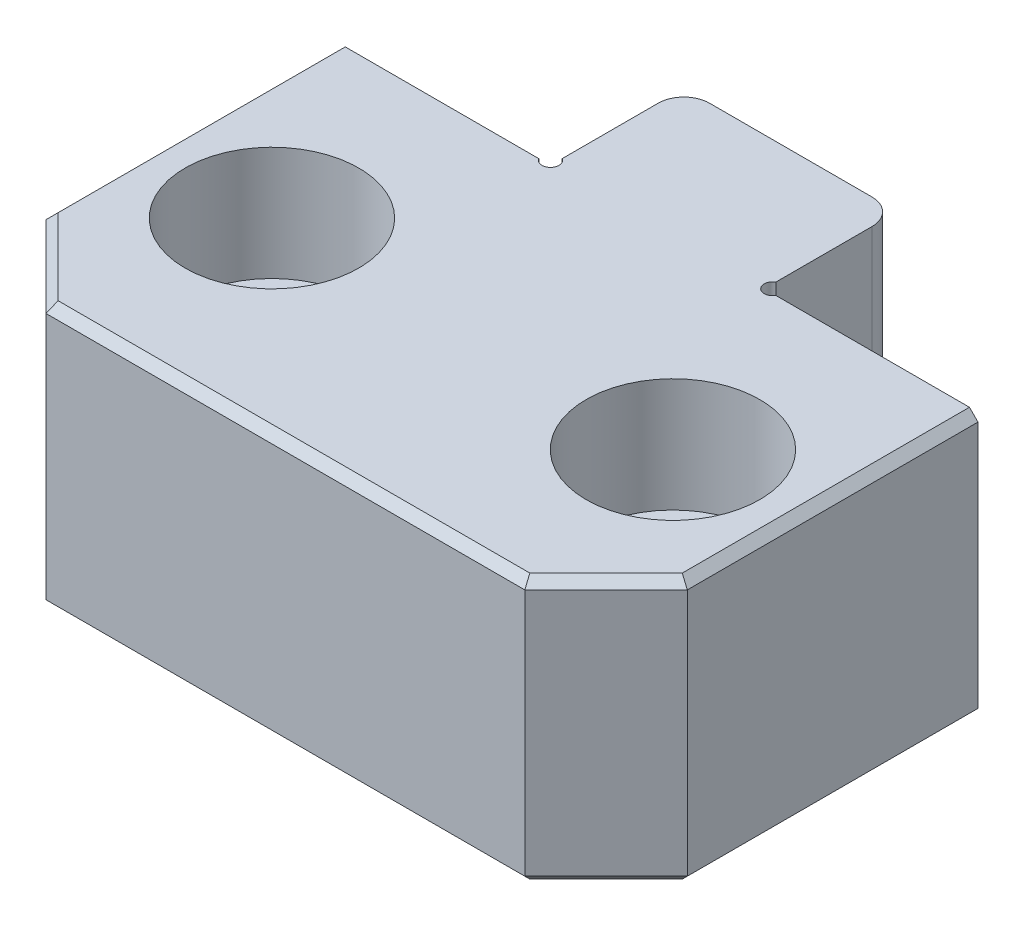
from build123d import *

# Parameters (mm, degrees)
EXTRUDE1_DEPTH     = 15.748
CHAMFER1_SIZE      = 4.826
SKETCH4_R          = 3.5687
CUT_EXTRUDE2_DEPTH = 15.748
FILLET2_R          = 1.524
CHAMFER3_SIZE      = 0.508
CUT_EXTRUDE4_START = -15.748
SKETCH5_R          = 5.1562
CUT_EXTRUDE4_DEPTH = 6.7564
SKETCH6_W          = 12.7
SKETCH6_H          = 7.9248
EXTRUDE2_DEPTH     = 0.254


with BuildPart() as part:
    # Sketch2 → Extrude1 (new body)
    with BuildSketch(Plane(origin=(0, 0, 0), x_dir=(1, 0, 0), z_dir=(0, 1, 0))):
        with BuildLine():
            Line((-6.35, 0.693940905), (-6.35, 7.9248))
            Line((-6.35, 7.9248), (6.35, 7.9248))
            Line((6.35, 7.9248), (6.35, 0.693940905))
            ThreePointArc((6.35, 0.693940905), (6.244789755, -0.105210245), (7.043940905, 0))
            Line((7.043940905, 0), (19.05, 0))
            Line((19.05, 0), (19.05, -22.098))
            Line((19.05, -22.098), (-19.05, -22.098))
            Line((-19.05, -22.098), (-19.05, 0))
            Line((-19.05, 0), (-7.043940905, 0))
            ThreePointArc((-7.043940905, 0), (-6.244789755, -0.105210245), (-6.35, 0.693940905))
        make_face()
    extrude(amount=EXTRUDE1_DEPTH)

    # Chamfer1
    chamfer1_edges = [part.edges().sort_by_distance(p)[0] for p in [
        (19.05, 7.874, 22.098),
        (-19.05, 7.874, 22.098),
    ]]
    chamfer(chamfer1_edges, length=CHAMFER1_SIZE)

    # Sketch4 → Cut-Extrude2 (cut)
    with BuildSketch(Plane.XZ):
        with Locations(Location((11.9126, 10.9855, 0), (0, 0, 270))):
            Circle(SKETCH4_R)
        with Locations(Location((-11.9126, 10.9855, 0), (0, 0, 270))):
            Circle(SKETCH4_R)
    extrude(amount=-CUT_EXTRUDE2_DEPTH, mode=Mode.SUBTRACT)

    # Fillet2
    fillet2_edges = [part.edges().sort_by_distance(p)[0] for p in [
        (-6.35, 7.874, -7.9248),
        (6.35, 7.874, -7.9248),
    ]]
    fillet(fillet2_edges, radius=FILLET2_R)

    # Chamfer3
    chamfer3_edges = [part.edges().sort_by_distance(p)[0] for p in [
        (-19.05, 0, 8.636),
        (19.05, 0, 8.636),
        (19.05, 15.748, 8.636),
        (0, 0, 22.098),
        (-16.637, 0, 19.685),
        (16.637, 0, 19.685),
        (0, 15.748, 22.098),
        (-16.637, 15.748, 19.685),
        (16.637, 15.748, 19.685),
        (-19.05, 15.748, 8.636),
    ]]
    chamfer(chamfer3_edges, length=CHAMFER3_SIZE)

    # Sketch5 → Cut-Extrude4 (cut)
    with BuildSketch(Plane.XZ.offset(CUT_EXTRUDE4_START)):
        with Locations(Location((11.9126, 10.9855, 0), (0, 0, 90))):
            Circle(SKETCH5_R)
        with Locations(Location((-11.9126, 10.9855, 0), (0, 0, 90))):
            Circle(SKETCH5_R)
    extrude(amount=CUT_EXTRUDE4_DEPTH, mode=Mode.SUBTRACT)

    # Sketch6 → Extrude2 (cut)
    with BuildSketch(Plane.XZ):
        with Locations((0, -3.9624)):
            Rectangle(SKETCH6_W, SKETCH6_H)
    extrude(amount=-EXTRUDE2_DEPTH, mode=Mode.SUBTRACT)


solid = part.part
